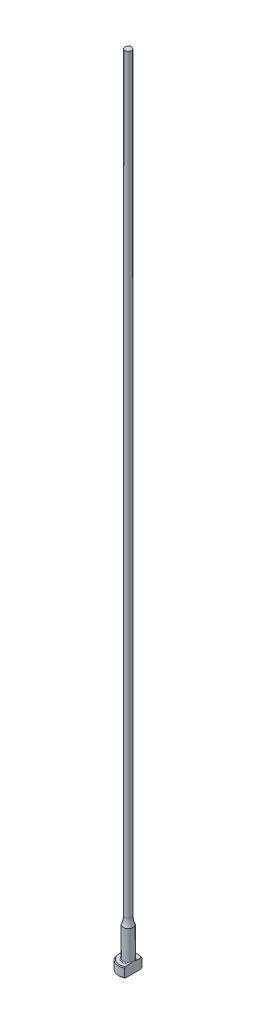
ISO-10303-21;
HEADER;
FILE_DESCRIPTION(('STEP AP214'),'2;1');
FILE_NAME('part.step','',(''),(''),'','','');
FILE_SCHEMA(('AUTOMOTIVE_DESIGN { 1 0 10303 214 1 1 1 1 }'));
ENDSEC;
DATA;
#1=APPLICATION_CONTEXT('core data for automotive mechanical design processes');
#2=APPLICATION_PROTOCOL_DEFINITION('international standard','automotive_design',2000,#1);
#3=PRODUCT_CONTEXT('',#1,'mechanical');
#4=PRODUCT('Part','Part','',(#3));
#5=PRODUCT_RELATED_PRODUCT_CATEGORY('part','',(#4));
#6=PRODUCT_DEFINITION_FORMATION('','',#4);
#7=PRODUCT_DEFINITION_CONTEXT('part definition',#1,'design');
#8=PRODUCT_DEFINITION('design','',#6,#7);
#9=PRODUCT_DEFINITION_SHAPE('','',#8);
#10=(LENGTH_UNIT() NAMED_UNIT(*) SI_UNIT(.MILLI.,.METRE.));
#11=(NAMED_UNIT(*) PLANE_ANGLE_UNIT() SI_UNIT($,.RADIAN.));
#12=(NAMED_UNIT(*) SI_UNIT($,.STERADIAN.) SOLID_ANGLE_UNIT());
#13=UNCERTAINTY_MEASURE_WITH_UNIT(LENGTH_MEASURE(1.E-05),#10,'distance_accuracy_value','');
#14=(GEOMETRIC_REPRESENTATION_CONTEXT(3) GLOBAL_UNCERTAINTY_ASSIGNED_CONTEXT((#13)) GLOBAL_UNIT_ASSIGNED_CONTEXT((#10,
#11,#12)) REPRESENTATION_CONTEXT('',''));
#15=CARTESIAN_POINT('',(0.,0.,0.));
#16=DIRECTION('',(0.,0.,1.));
#17=DIRECTION('',(1.,0.,0.));
#18=AXIS2_PLACEMENT_3D('',#15,#16,#17);
#19=CARTESIAN_POINT('',(-3.17499999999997,3.175,0.));
#20=DIRECTION('',(0.,1.,0.));
#21=DIRECTION('',(0.,0.,1.));
#22=AXIS2_PLACEMENT_3D('',#19,#20,#21);
#23=PLANE('',#22);
#24=CARTESIAN_POINT('',(0.,3.175,0.));
#25=DIRECTION('',(0.,1.,0.));
#26=DIRECTION('',(0.,0.,1.));
#27=AXIS2_PLACEMENT_3D('',#24,#25,#26);
#28=CIRCLE('',#27,2.92099999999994);
#29=CARTESIAN_POINT('',(1.58749999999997,3.175,-2.45195529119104));
#30=VERTEX_POINT('',#29);
#31=CARTESIAN_POINT('',(1.58749999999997,3.175,2.45195529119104));
#32=VERTEX_POINT('',#31);
#33=EDGE_CURVE('E105',#30,#32,#28,.T.);
#34=ORIENTED_EDGE('',*,*,#33,.T.);
#35=DIRECTION('',(0.,0.,1.));
#36=VECTOR('',#35,1.);
#37=CARTESIAN_POINT('',(1.58749999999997,3.17499999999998,2.74963065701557));
#38=LINE('',#37,#36);
#39=CARTESIAN_POINT('',(1.58749999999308,3.175,0.933255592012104));
#40=VERTEX_POINT('',#39);
#41=EDGE_CURVE('E126',#40,#32,#38,.T.);
#42=ORIENTED_EDGE('',*,*,#41,.F.);
#43=CARTESIAN_POINT('',(0.,3.175,0.));
#44=DIRECTION('',(0.,1.,0.));
#45=DIRECTION('',(0.,0.,1.));
#46=AXIS2_PLACEMENT_3D('',#43,#44,#45);
#47=CIRCLE('',#46,1.84149999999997);
#48=CARTESIAN_POINT('',(1.58749999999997,3.17500000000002,-0.933255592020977));
#49=VERTEX_POINT('',#48);
#50=EDGE_CURVE('E11',#40,#49,#47,.F.);
#51=ORIENTED_EDGE('',*,*,#50,.T.);
#52=EDGE_CURVE('E52',#30,#49,#38,.T.);
#53=ORIENTED_EDGE('',*,*,#52,.F.);
#54=EDGE_LOOP('',(#34,#42,#51,#53));
#55=FACE_BOUND('',#54,.T.);
#56=ADVANCED_FACE('F32',(#55),#23,.T.);
#57=CARTESIAN_POINT('',(0.,259.958771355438,0.));
#58=DIRECTION('',(0.,1.,0.));
#59=DIRECTION('',(0.,0.,1.));
#60=AXIS2_PLACEMENT_3D('',#57,#58,#59);
#61=CYLINDRICAL_SURFACE('',#60,3.17499999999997);
#62=CARTESIAN_POINT('',(0.,2.92100000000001,0.));
#63=DIRECTION('',(0.,1.,0.));
#64=DIRECTION('',(0.,0.,1.));
#65=AXIS2_PLACEMENT_3D('',#62,#63,#64);
#66=CIRCLE('',#65,3.17499999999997);
#67=CARTESIAN_POINT('',(1.58749999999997,2.92100000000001,2.74963065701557));
#68=VERTEX_POINT('',#67);
#69=CARTESIAN_POINT('',(1.58749999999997,2.92100000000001,-2.74963065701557));
#70=VERTEX_POINT('',#69);
#71=EDGE_CURVE('E98',#68,#70,#66,.F.);
#72=ORIENTED_EDGE('',*,*,#71,.T.);
#73=DIRECTION('',(0.,-1.,0.));
#74=VECTOR('',#73,1.);
#75=CARTESIAN_POINT('',(1.58749999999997,254.001,-2.74963065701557));
#76=LINE('',#75,#74);
#77=CARTESIAN_POINT('',(1.58749999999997,0.253999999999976,-2.74963065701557));
#78=VERTEX_POINT('',#77);
#79=EDGE_CURVE('E141',#70,#78,#76,.T.);
#80=ORIENTED_EDGE('',*,*,#79,.T.);
#81=CARTESIAN_POINT('',(0.,0.253999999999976,0.));
#82=DIRECTION('',(0.,-1.,0.));
#83=DIRECTION('',(0.,0.,-1.));
#84=AXIS2_PLACEMENT_3D('',#81,#82,#83);
#85=CIRCLE('',#84,3.17499999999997);
#86=CARTESIAN_POINT('',(1.58749999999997,0.253999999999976,2.74963065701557));
#87=VERTEX_POINT('',#86);
#88=EDGE_CURVE('E95',#78,#87,#85,.F.);
#89=ORIENTED_EDGE('',*,*,#88,.T.);
#90=DIRECTION('',(0.,-1.,0.));
#91=VECTOR('',#90,1.);
#92=CARTESIAN_POINT('',(1.58749999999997,254.001,2.74963065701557));
#93=LINE('',#92,#91);
#94=EDGE_CURVE('E88',#68,#87,#93,.T.);
#95=ORIENTED_EDGE('',*,*,#94,.F.);
#96=EDGE_LOOP('',(#72,#80,#89,#95));
#97=FACE_BOUND('',#96,.T.);
#98=ADVANCED_FACE('F191',(#97),#61,.T.);
#99=CARTESIAN_POINT('',(0.,0.,0.));
#100=DIRECTION('',(0.,-1.,0.));
#101=DIRECTION('',(0.,0.,-1.));
#102=AXIS2_PLACEMENT_3D('',#99,#100,#101);
#103=PLANE('',#102);
#104=CARTESIAN_POINT('',(0.,0.,0.));
#105=DIRECTION('',(0.,-1.,0.));
#106=DIRECTION('',(0.,0.,-1.));
#107=AXIS2_PLACEMENT_3D('',#104,#105,#106);
#108=CIRCLE('',#107,2.92100000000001);
#109=CARTESIAN_POINT('',(1.58749999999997,0.,2.45195529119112));
#110=VERTEX_POINT('',#109);
#111=CARTESIAN_POINT('',(1.58749999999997,0.,-2.45195529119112));
#112=VERTEX_POINT('',#111);
#113=EDGE_CURVE('E93',#110,#112,#108,.T.);
#114=ORIENTED_EDGE('',*,*,#113,.T.);
#115=DIRECTION('',(0.,0.,1.));
#116=VECTOR('',#115,1.);
#117=CARTESIAN_POINT('',(1.58749999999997,0.,2.74963065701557));
#118=LINE('',#117,#116);
#119=EDGE_CURVE('E78',#112,#110,#118,.T.);
#120=ORIENTED_EDGE('',*,*,#119,.T.);
#121=EDGE_LOOP('',(#114,#120));
#122=FACE_BOUND('',#121,.T.);
#123=ADVANCED_FACE('F97',(#122),#103,.T.);
#124=CARTESIAN_POINT('',(0.,3.17499999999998,0.));
#125=DIRECTION('',(0.,-1.,0.));
#126=DIRECTION('',(0.,0.,-1.));
#127=AXIS2_PLACEMENT_3D('',#124,#125,#126);
#128=CONICAL_SURFACE('',#127,2.92099999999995,0.785398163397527);
#129=ORIENTED_EDGE('',*,*,#71,.F.);
#130=CARTESIAN_POINT('',(1.58749999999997,-0.16162066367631,-6.0529050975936));
#131=CARTESIAN_POINT('',(1.58749999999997,-0.0288893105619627,-5.91567682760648));
#132=CARTESIAN_POINT('',(1.58749999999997,0.103699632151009,-5.7783103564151));
#133=CARTESIAN_POINT('',(1.58749999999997,0.368508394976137,-5.50321874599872));
#134=CARTESIAN_POINT('',(1.58749999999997,0.500728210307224,-5.36549360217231));
#135=CARTESIAN_POINT('',(1.58749999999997,0.764778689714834,-5.08953516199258));
#136=CARTESIAN_POINT('',(1.58749999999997,0.896609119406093,-4.9513016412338));
#137=CARTESIAN_POINT('',(1.58749999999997,1.15968706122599,-4.67428233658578));
#138=CARTESIAN_POINT('',(1.58749999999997,1.29093457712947,-4.53549655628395));
#139=CARTESIAN_POINT('',(1.58749999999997,1.55007705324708,-4.25997724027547));
#140=CARTESIAN_POINT('',(1.58749999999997,1.67798684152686,-4.12325766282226));
#141=CARTESIAN_POINT('',(1.58749999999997,1.9328486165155,-3.84892898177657));
#142=CARTESIAN_POINT('',(1.58749999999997,2.05980060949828,-3.71131988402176));
#143=CARTESIAN_POINT('',(1.58749999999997,2.31237508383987,-3.43493978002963));
#144=CARTESIAN_POINT('',(1.58749999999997,2.43799784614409,-3.29616903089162));
#145=CARTESIAN_POINT('',(1.58749999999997,2.68741369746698,-3.01699558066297));
#146=CARTESIAN_POINT('',(1.58749999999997,2.81120686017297,-2.8765929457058));
#147=CARTESIAN_POINT('',(1.58749999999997,3.00875865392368,-2.64816703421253));
#148=CARTESIAN_POINT('',(1.58749999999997,3.08336151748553,-2.56087478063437));
#149=CARTESIAN_POINT('',(1.58749999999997,3.2312387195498,-2.38515423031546));
#150=CARTESIAN_POINT('',(1.58749999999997,3.30451292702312,-2.29672582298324));
#151=CARTESIAN_POINT('',(1.58749999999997,3.45004422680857,-2.1174740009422));
#152=CARTESIAN_POINT('',(1.58749999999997,3.5222823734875,-2.02663514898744));
#153=CARTESIAN_POINT('',(1.58749999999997,3.66423097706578,-1.8430252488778));
#154=CARTESIAN_POINT('',(1.58749999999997,3.73394203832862,-1.75025467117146));
#155=CARTESIAN_POINT('',(1.58749999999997,3.87080633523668,-1.5606747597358));
#156=CARTESIAN_POINT('',(1.58749999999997,3.93790459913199,-1.46382547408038));
#157=CARTESIAN_POINT('',(1.58749999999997,4.06669147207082,-1.26632594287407));
#158=CARTESIAN_POINT('',(1.58749999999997,4.1283726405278,-1.16567073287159));
#159=CARTESIAN_POINT('',(1.58749999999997,4.21402252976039,-1.01165766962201));
#160=CARTESIAN_POINT('',(1.58749999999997,4.24127929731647,-0.960142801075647));
#161=CARTESIAN_POINT('',(1.58749999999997,4.2930979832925,-0.855780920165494));
#162=CARTESIAN_POINT('',(1.58749999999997,4.31765941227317,-0.802933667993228));
#163=CARTESIAN_POINT('',(1.58749999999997,4.38614656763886,-0.642461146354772));
#164=CARTESIAN_POINT('',(1.58749999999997,4.42510149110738,-0.532518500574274));
#165=CARTESIAN_POINT('',(1.58749999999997,4.46726244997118,-0.367680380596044));
#166=CARTESIAN_POINT('',(1.58749999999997,4.47844427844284,-0.314802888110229));
#167=CARTESIAN_POINT('',(1.58749999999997,4.49576654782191,-0.208209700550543));
#168=CARTESIAN_POINT('',(1.58749999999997,4.50190743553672,-0.154494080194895));
#169=CARTESIAN_POINT('',(1.58749999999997,4.50871296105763,-0.0468792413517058));
#170=CARTESIAN_POINT('',(1.58749999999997,4.5093945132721,0.00701889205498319));
#171=CARTESIAN_POINT('',(1.58749999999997,4.50527679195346,0.114606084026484));
#172=CARTESIAN_POINT('',(1.58749999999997,4.50047706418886,0.168295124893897));
#173=CARTESIAN_POINT('',(1.58749999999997,4.48579689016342,0.27448544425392));
#174=CARTESIAN_POINT('',(1.58749999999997,4.47596081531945,0.32699298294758));
#175=CARTESIAN_POINT('',(1.58749999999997,4.45181809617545,0.430974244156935));
#176=CARTESIAN_POINT('',(1.58749999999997,4.4375096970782,0.482447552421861));
#177=CARTESIAN_POINT('',(1.58749999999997,4.40502489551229,0.584460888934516));
#178=CARTESIAN_POINT('',(1.58749999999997,4.386827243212,0.634994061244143));
#179=CARTESIAN_POINT('',(1.58749999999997,4.34729308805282,0.734789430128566));
#180=CARTESIAN_POINT('',(1.58749999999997,4.3259572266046,0.784051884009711));
#181=CARTESIAN_POINT('',(1.58749999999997,4.25791922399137,0.930549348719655));
#182=CARTESIAN_POINT('',(1.58749999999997,4.20736047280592,1.0259880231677));
#183=CARTESIAN_POINT('',(1.58749999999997,4.0995545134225,1.21304313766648));
#184=CARTESIAN_POINT('',(1.58749999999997,4.04229912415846,1.30465471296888));
#185=CARTESIAN_POINT('',(1.58749999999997,3.92308746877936,1.48526211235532));
#186=CARTESIAN_POINT('',(1.58749999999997,3.86111349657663,1.57424615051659));
#187=CARTESIAN_POINT('',(1.58749999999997,3.73408621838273,1.74990003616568));
#188=CARTESIAN_POINT('',(1.58749999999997,3.66903444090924,1.83657099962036));
#189=CARTESIAN_POINT('',(1.58749999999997,3.53583371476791,2.00931764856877));
#190=CARTESIAN_POINT('',(1.58749999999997,3.46765527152,2.09537048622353));
#191=CARTESIAN_POINT('',(1.58749999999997,3.32960643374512,2.26611736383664));
#192=CARTESIAN_POINT('',(1.58749999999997,3.25973586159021,2.35081125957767));
#193=CARTESIAN_POINT('',(1.58749999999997,3.04858139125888,2.60290121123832));
#194=CARTESIAN_POINT('',(1.58749999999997,2.90542388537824,2.76872537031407));
#195=CARTESIAN_POINT('',(1.58749999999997,2.64069522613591,3.06970913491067));
#196=CARTESIAN_POINT('',(1.58749999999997,2.51959458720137,3.20528660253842));
#197=CARTESIAN_POINT('',(1.58749999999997,2.27590400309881,3.47510321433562));
#198=CARTESIAN_POINT('',(1.58749999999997,2.15331401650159,3.60934232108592));
#199=CARTESIAN_POINT('',(1.58749999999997,1.90694239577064,3.87695374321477));
#200=CARTESIAN_POINT('',(1.58749999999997,1.78315974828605,4.0103251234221));
#201=CARTESIAN_POINT('',(1.58749999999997,1.53478104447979,4.27630880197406));
#202=CARTESIAN_POINT('',(1.58749999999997,1.41018498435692,4.40892109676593));
#203=CARTESIAN_POINT('',(1.58749999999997,1.0457468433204,4.79499418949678));
#204=CARTESIAN_POINT('',(1.58749999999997,0.80507680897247,5.04767313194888));
#205=CARTESIAN_POINT('',(1.58749999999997,0.443121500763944,5.42550911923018));
#206=CARTESIAN_POINT('',(1.58749999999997,0.322378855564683,5.55118772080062));
#207=CARTESIAN_POINT('',(1.58749999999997,0.0805914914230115,5.80225207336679));
#208=CARTESIAN_POINT('',(1.58749999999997,-0.040453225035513,5.92763782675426));
#209=CARTESIAN_POINT('',(1.58749999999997,-0.161620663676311,6.0529050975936));
#210=B_SPLINE_CURVE_WITH_KNOTS('',3,(#130,#131,#132,#133,#134,#135,#136,#137,#138,#139,#140,
#141,#142,#143,#144,#145,#146,#147,#148,#149,#150,#151,#152,#153,#154,#155,#156,#157,#158,#159,
#160,#161,#162,#163,#164,#165,#166,#167,#168,#169,#170,#171,#172,#173,#174,#175,#176,#177,#178,
#179,#180,#181,#182,#183,#184,#185,#186,#187,#188,#189,#190,#191,#192,#193,#194,#195,#196,#197,
#198,#199,#200,#201,#202,#203,#204,#205,#206,#207,#208,#209),.UNSPECIFIED.,.F.,.F.,(4,2,2,2,2,2,
2,2,2,2,2,2,2,2,2,2,2,2,2,2,2,2,2,2,2,2,2,2,2,2,2,2,2,2,2,2,2,2,2,4),(0.,0.572750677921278,
1.14550874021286,1.71856057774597,2.29160869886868,2.85328006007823,3.4149477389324,
3.97649423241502,4.53801804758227,4.88249307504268,5.22700189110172,5.5751532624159,
5.92322081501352,6.27657800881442,6.63041319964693,6.80518126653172,6.9799810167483,
7.3282426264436,7.49018491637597,7.65211285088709,7.81353889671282,7.97497832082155,
8.13501929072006,8.29512313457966,8.45612518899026,8.61709438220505,8.94062993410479,
9.2645649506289,9.58978187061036,9.91483894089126,10.2441741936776,10.5735441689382,
11.2306812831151,11.7760337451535,12.3214014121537,12.8672825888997,13.4131663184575,
14.4600164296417,14.9828595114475,15.5056983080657),.UNSPECIFIED.);
#211=EDGE_CURVE('E118',#32,#68,#210,.T.);
#212=ORIENTED_EDGE('',*,*,#211,.F.);
#213=ORIENTED_EDGE('',*,*,#33,.F.);
#214=EDGE_CURVE('E117',#70,#30,#210,.T.);
#215=ORIENTED_EDGE('',*,*,#214,.F.);
#216=EDGE_LOOP('',(#129,#212,#213,#215));
#217=FACE_BOUND('',#216,.T.);
#218=ADVANCED_FACE('F162',(#217),#128,.T.);
#219=CARTESIAN_POINT('',(0.,0.253999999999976,0.));
#220=DIRECTION('',(0.,1.,0.));
#221=DIRECTION('',(0.,0.,1.));
#222=AXIS2_PLACEMENT_3D('',#219,#220,#221);
#223=CONICAL_SURFACE('',#222,3.17499999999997,0.785398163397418);
#224=ORIENTED_EDGE('',*,*,#88,.F.);
#225=CARTESIAN_POINT('',(1.58749999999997,3.33662066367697,6.0529050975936));
#226=CARTESIAN_POINT('',(1.58749999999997,3.20388931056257,5.91567682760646));
#227=CARTESIAN_POINT('',(1.58749999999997,3.07130036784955,5.77831035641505));
#228=CARTESIAN_POINT('',(1.58749999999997,2.80649160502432,5.50321874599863));
#229=CARTESIAN_POINT('',(1.58749999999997,2.67427178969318,5.3654936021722));
#230=CARTESIAN_POINT('',(1.58749999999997,2.41022131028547,5.08953516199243));
#231=CARTESIAN_POINT('',(1.58749999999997,2.27839088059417,4.95130164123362));
#232=CARTESIAN_POINT('',(1.58749999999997,2.01531293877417,4.67428233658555));
#233=CARTESIAN_POINT('',(1.58749999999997,1.88406542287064,4.5354965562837));
#234=CARTESIAN_POINT('',(1.58749999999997,1.62492294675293,4.25997724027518));
#235=CARTESIAN_POINT('',(1.58749999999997,1.49701315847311,4.12325766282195));
#236=CARTESIAN_POINT('',(1.58749999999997,1.24215138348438,3.84892898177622));
#237=CARTESIAN_POINT('',(1.58749999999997,1.11519939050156,3.71131988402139));
#238=CARTESIAN_POINT('',(1.58749999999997,0.862624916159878,3.43493978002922));
#239=CARTESIAN_POINT('',(1.58749999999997,0.737002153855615,3.29616903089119));
#240=CARTESIAN_POINT('',(1.58749999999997,0.487586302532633,3.01699558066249));
#241=CARTESIAN_POINT('',(1.58749999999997,0.363793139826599,2.8765929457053));
#242=CARTESIAN_POINT('',(1.58749999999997,0.166241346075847,2.64816703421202));
#243=CARTESIAN_POINT('',(1.58749999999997,0.0916384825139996,2.56087478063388));
#244=CARTESIAN_POINT('',(1.58749999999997,-0.0562387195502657,2.385154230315));
#245=CARTESIAN_POINT('',(1.58749999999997,-0.129512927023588,2.29672582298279));
#246=CARTESIAN_POINT('',(1.58749999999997,-0.27504422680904,2.11747400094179));
#247=CARTESIAN_POINT('',(1.58749999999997,-0.347282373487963,2.02663514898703));
#248=CARTESIAN_POINT('',(1.58749999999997,-0.489230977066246,1.84302524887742));
#249=CARTESIAN_POINT('',(1.58749999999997,-0.558942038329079,1.7502546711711));
#250=CARTESIAN_POINT('',(1.58749999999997,-0.695806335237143,1.56067475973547));
#251=CARTESIAN_POINT('',(1.58749999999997,-0.762904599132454,1.46382547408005));
#252=CARTESIAN_POINT('',(1.58749999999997,-0.891691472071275,1.26632594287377));
#253=CARTESIAN_POINT('',(1.58749999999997,-0.953372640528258,1.16567073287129));
#254=CARTESIAN_POINT('',(1.58749999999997,-1.03902252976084,1.01165766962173));
#255=CARTESIAN_POINT('',(1.58749999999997,-1.06627929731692,0.960142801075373));
#256=CARTESIAN_POINT('',(1.58749999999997,-1.11809798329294,0.85578092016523));
#257=CARTESIAN_POINT('',(1.58749999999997,-1.14265941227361,0.802933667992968));
#258=CARTESIAN_POINT('',(1.58749999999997,-1.21114656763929,0.642461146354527));
#259=CARTESIAN_POINT('',(1.58749999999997,-1.2501014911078,0.532518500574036));
#260=CARTESIAN_POINT('',(1.58749999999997,-1.29226244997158,0.367680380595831));
#261=CARTESIAN_POINT('',(1.58749999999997,-1.30344427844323,0.314802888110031));
#262=CARTESIAN_POINT('',(1.58749999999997,-1.32076654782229,0.208209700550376));
#263=CARTESIAN_POINT('',(1.58749999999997,-1.3269074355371,0.154494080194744));
#264=CARTESIAN_POINT('',(1.58749999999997,-1.333712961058,0.0468792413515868));
#265=CARTESIAN_POINT('',(1.58749999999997,-1.33439451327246,-0.00701889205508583));
#266=CARTESIAN_POINT('',(1.58749999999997,-1.33027679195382,-0.114606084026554));
#267=CARTESIAN_POINT('',(1.58749999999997,-1.32547706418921,-0.168295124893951));
#268=CARTESIAN_POINT('',(1.58749999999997,-1.31079689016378,-0.274485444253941));
#269=CARTESIAN_POINT('',(1.58749999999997,-1.3009608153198,-0.326992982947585));
#270=CARTESIAN_POINT('',(1.58749999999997,-1.27681809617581,-0.430974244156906));
#271=CARTESIAN_POINT('',(1.58749999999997,-1.26250969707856,-0.482447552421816));
#272=CARTESIAN_POINT('',(1.58749999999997,-1.23002489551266,-0.584460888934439));
#273=CARTESIAN_POINT('',(1.58749999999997,-1.21182724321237,-0.634994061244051));
#274=CARTESIAN_POINT('',(1.58749999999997,-1.1722930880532,-0.734789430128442));
#275=CARTESIAN_POINT('',(1.58749999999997,-1.15095722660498,-0.784051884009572));
#276=CARTESIAN_POINT('',(1.58749999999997,-1.08291922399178,-0.93054934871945));
#277=CARTESIAN_POINT('',(1.58749999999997,-1.03236047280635,-1.02598802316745));
#278=CARTESIAN_POINT('',(1.58749999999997,-0.924554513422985,-1.21304313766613));
#279=CARTESIAN_POINT('',(1.58749999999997,-0.86729912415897,-1.30465471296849));
#280=CARTESIAN_POINT('',(1.58749999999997,-0.748087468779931,-1.48526211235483));
#281=CARTESIAN_POINT('',(1.58749999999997,-0.686113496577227,-1.57424615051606));
#282=CARTESIAN_POINT('',(1.58749999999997,-0.55908621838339,-1.74990003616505));
#283=CARTESIAN_POINT('',(1.58749999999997,-0.494034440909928,-1.83657099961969));
#284=CARTESIAN_POINT('',(1.58749999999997,-0.360833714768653,-2.00931764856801));
#285=CARTESIAN_POINT('',(1.58749999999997,-0.292655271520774,-2.09537048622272));
#286=CARTESIAN_POINT('',(1.58749999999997,-0.154606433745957,-2.26611736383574));
#287=CARTESIAN_POINT('',(1.58749999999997,-0.0847358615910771,-2.35081125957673));
#288=CARTESIAN_POINT('',(1.58749999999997,0.126418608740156,-2.60290121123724));
#289=CARTESIAN_POINT('',(1.58749999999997,0.269576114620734,-2.76872537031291));
#290=CARTESIAN_POINT('',(1.58749999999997,0.534304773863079,-3.06970913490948));
#291=CARTESIAN_POINT('',(1.58749999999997,0.655405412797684,-3.20528660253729));
#292=CARTESIAN_POINT('',(1.58749999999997,0.899095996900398,-3.47510321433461));
#293=CARTESIAN_POINT('',(1.58749999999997,1.02168598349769,-3.60934232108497));
#294=CARTESIAN_POINT('',(1.58749999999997,1.26805760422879,-3.87695374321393));
#295=CARTESIAN_POINT('',(1.58749999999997,1.39184025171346,-4.01032512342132));
#296=CARTESIAN_POINT('',(1.58749999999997,1.64021895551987,-4.2763088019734));
#297=CARTESIAN_POINT('',(1.58749999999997,1.76481501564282,-4.40892109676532));
#298=CARTESIAN_POINT('',(1.58749999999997,2.12925315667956,-4.79499418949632));
#299=CARTESIAN_POINT('',(1.58749999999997,2.36992319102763,-5.04767313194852));
#300=CARTESIAN_POINT('',(1.58749999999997,2.73187849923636,-5.42550911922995));
#301=CARTESIAN_POINT('',(1.58749999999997,2.85262114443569,-5.55118772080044));
#302=CARTESIAN_POINT('',(1.58749999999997,3.09440850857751,-5.8022520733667));
#303=CARTESIAN_POINT('',(1.58749999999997,3.2154532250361,-5.92763782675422));
#304=CARTESIAN_POINT('',(1.58749999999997,3.33662066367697,-6.0529050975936));
#305=B_SPLINE_CURVE_WITH_KNOTS('',3,(#225,#226,#227,#228,#229,#230,#231,#232,#233,#234,#235,
#236,#237,#238,#239,#240,#241,#242,#243,#244,#245,#246,#247,#248,#249,#250,#251,#252,#253,#254,
#255,#256,#257,#258,#259,#260,#261,#262,#263,#264,#265,#266,#267,#268,#269,#270,#271,#272,#273,
#274,#275,#276,#277,#278,#279,#280,#281,#282,#283,#284,#285,#286,#287,#288,#289,#290,#291,#292,
#293,#294,#295,#296,#297,#298,#299,#300,#301,#302,#303,#304),.UNSPECIFIED.,.F.,.F.,(4,2,2,2,2,2,
2,2,2,2,2,2,2,2,2,2,2,2,2,2,2,2,2,2,2,2,2,2,2,2,2,2,2,2,2,2,2,2,2,4),(0.,0.57275067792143,
1.14550874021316,1.71856057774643,2.29160869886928,2.85328006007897,3.41494773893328,
3.97649423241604,4.53801804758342,4.88249307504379,5.2270018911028,5.57515326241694,
5.92322081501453,6.27657800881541,6.63041319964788,6.80518126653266,6.97998101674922,
7.32824262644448,7.49018491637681,7.65211285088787,7.81353889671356,7.97497832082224,
8.1350192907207,8.29512313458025,8.45612518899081,8.61709438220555,8.94062993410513,
9.26456495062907,9.58978187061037,9.91483894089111,10.2441741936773,10.5735441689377,
11.2306812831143,11.776033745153,12.3214014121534,12.8672825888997,13.4131663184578,
14.4600164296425,14.9828595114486,15.505698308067),.UNSPECIFIED.);
#306=EDGE_CURVE('E81',#112,#78,#305,.T.);
#307=ORIENTED_EDGE('',*,*,#306,.F.);
#308=ORIENTED_EDGE('',*,*,#113,.F.);
#309=EDGE_CURVE('E84',#87,#110,#305,.T.);
#310=ORIENTED_EDGE('',*,*,#309,.F.);
#311=EDGE_LOOP('',(#224,#307,#308,#310));
#312=FACE_BOUND('',#311,.T.);
#313=ADVANCED_FACE('F92',(#312),#223,.T.);
#314=CARTESIAN_POINT('',(0.,3.42900000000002,0.));
#315=DIRECTION('',(0.,1.,0.));
#316=DIRECTION('',(0.,0.,1.));
#317=AXIS2_PLACEMENT_3D('',#314,#315,#316);
#318=TOROIDAL_SURFACE('',#317,1.84149999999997,0.254);
#319=CARTESIAN_POINT('',(1.58749999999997,3.42900000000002,0.));
#320=CARTESIAN_POINT('',(1.58749999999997,3.42899942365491,-1.9220514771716E-10));
#321=CARTESIAN_POINT('',(1.58749999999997,3.42899884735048,-1.2261161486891E-07));
#322=CARTESIAN_POINT('',(1.58749999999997,3.42899773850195,-5.09676365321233E-07));
#323=CARTESIAN_POINT('',(1.58749999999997,3.42899720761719,-7.78176328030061E-07));
#324=CARTESIAN_POINT('',(1.58749999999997,3.42899614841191,-1.42307272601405E-06));
#325=CARTESIAN_POINT('',(1.58749999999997,3.42899562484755,-1.80713867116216E-06));
#326=CARTESIAN_POINT('',(1.58749999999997,3.42899463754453,-2.63494846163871E-06));
#327=CARTESIAN_POINT('',(1.58749999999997,3.42899417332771,-3.07814756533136E-06));
#328=CARTESIAN_POINT('',(1.58749999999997,3.42899261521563,-4.66897357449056E-06));
#329=CARTESIAN_POINT('',(1.58749999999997,3.42899159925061,-5.89404908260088E-06));
#330=CARTESIAN_POINT('',(1.58749999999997,3.42898979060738,-8.42427511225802E-06));
#331=CARTESIAN_POINT('',(1.58749999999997,3.42898899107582,-9.7248057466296E-06));
#332=CARTESIAN_POINT('',(1.58749999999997,3.42898598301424,-1.48060601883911E-05));
#333=CARTESIAN_POINT('',(1.58749999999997,3.42898393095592,-1.86838281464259E-05));
#334=CARTESIAN_POINT('',(1.58749999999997,3.42898057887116,-2.63261117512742E-05));
#335=CARTESIAN_POINT('',(1.58749999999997,3.42897922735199,-3.00687417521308E-05));
#336=CARTESIAN_POINT('',(1.58749999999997,3.42897347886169,-4.60276298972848E-05));
#337=CARTESIAN_POINT('',(1.58749999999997,3.42896911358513,-5.8247019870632E-05));
#338=CARTESIAN_POINT('',(1.58749999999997,3.42896211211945,-8.11070097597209E-05));
#339=CARTESIAN_POINT('',(1.58749999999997,3.42895931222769,-9.16953114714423E-05));
#340=CARTESIAN_POINT('',(1.58749999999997,3.42893712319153,-0.000168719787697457));
#341=CARTESIAN_POINT('',(1.58749999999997,3.42890881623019,-0.000232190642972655));
#342=CARTESIAN_POINT('',(1.58749999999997,3.42880276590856,-0.000479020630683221));
#343=CARTESIAN_POINT('',(1.58749999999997,3.42873165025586,-0.00066443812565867));
#344=CARTESIAN_POINT('',(1.58749999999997,3.42845137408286,-0.0013844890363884));
#345=CARTESIAN_POINT('',(1.58749999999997,3.42823526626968,-0.00191701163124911));
#346=CARTESIAN_POINT('',(1.58749999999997,3.42735449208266,-0.00409774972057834));
#347=CARTESIAN_POINT('',(1.58749999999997,3.42669768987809,-0.00574830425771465));
#348=CARTESIAN_POINT('',(1.58749999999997,3.4174405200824,-0.0289985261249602));
#349=CARTESIAN_POINT('',(1.58749999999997,3.40878325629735,-0.0505816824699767));
#350=CARTESIAN_POINT('',(1.58749999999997,3.39189297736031,-0.0929947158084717));
#351=CARTESIAN_POINT('',(1.58749999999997,3.38365605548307,-0.11382315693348));
#352=CARTESIAN_POINT('',(1.58749999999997,3.36635393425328,-0.157956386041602));
#353=CARTESIAN_POINT('',(1.58749999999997,3.35730391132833,-0.181267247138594));
#354=CARTESIAN_POINT('',(1.58749999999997,3.33936775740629,-0.228222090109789));
#355=CARTESIAN_POINT('',(1.58749999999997,3.33048420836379,-0.25186705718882));
#356=CARTESIAN_POINT('',(1.58749999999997,3.30894496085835,-0.310512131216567));
#357=CARTESIAN_POINT('',(1.58749999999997,3.29649449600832,-0.345588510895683));
#358=CARTESIAN_POINT('',(1.58749999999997,3.27296975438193,-0.415278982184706));
#359=CARTESIAN_POINT('',(1.58749999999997,3.26186987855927,-0.449884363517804));
#360=CARTESIAN_POINT('',(1.58749999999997,3.2395832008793,-0.524471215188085));
#361=CARTESIAN_POINT('',(1.58749999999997,3.22860862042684,-0.564517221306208));
#362=CARTESIAN_POINT('',(1.58749999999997,3.20902534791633,-0.645529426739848));
#363=CARTESIAN_POINT('',(1.58749999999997,3.20043582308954,-0.686500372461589));
#364=CARTESIAN_POINT('',(1.58749999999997,3.18611712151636,-0.771546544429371));
#365=CARTESIAN_POINT('',(1.58749999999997,3.18059550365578,-0.815658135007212));
#366=CARTESIAN_POINT('',(1.58749999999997,3.17455396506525,-0.904117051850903));
#367=CARTESIAN_POINT('',(1.58749999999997,3.17401361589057,-0.948462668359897));
#368=CARTESIAN_POINT('',(1.58749999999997,3.17898948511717,-1.02531896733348));
#369=CARTESIAN_POINT('',(1.58749999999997,3.1829739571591,-1.05792141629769));
#370=CARTESIAN_POINT('',(1.58749999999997,3.19569167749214,-1.12184393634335));
#371=CARTESIAN_POINT('',(1.58749999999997,3.20436049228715,-1.1531753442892));
#372=CARTESIAN_POINT('',(1.58749999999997,3.22236152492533,-1.19946468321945));
#373=CARTESIAN_POINT('',(1.58749999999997,3.2295150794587,-1.21526783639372));
#374=CARTESIAN_POINT('',(1.58749999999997,3.24587062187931,-1.24583726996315));
#375=CARTESIAN_POINT('',(1.58749999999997,3.25507530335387,-1.26060215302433));
#376=CARTESIAN_POINT('',(1.58749999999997,3.27378481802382,-1.28575815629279));
#377=CARTESIAN_POINT('',(1.58749999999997,3.28289001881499,-1.29644383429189));
#378=CARTESIAN_POINT('',(1.58749999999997,3.30268460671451,-1.31623154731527));
#379=CARTESIAN_POINT('',(1.58749999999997,3.31337067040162,-1.32533681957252));
#380=CARTESIAN_POINT('',(1.58749999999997,3.33349977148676,-1.33941140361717));
#381=CARTESIAN_POINT('',(1.58749999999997,3.34261446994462,-1.34484814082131));
#382=CARTESIAN_POINT('',(1.58749999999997,3.36161455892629,-1.35416329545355));
#383=CARTESIAN_POINT('',(1.58749999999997,3.37149946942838,-1.35804267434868));
#384=CARTESIAN_POINT('',(1.58749999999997,3.39188678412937,-1.36398436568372));
#385=CARTESIAN_POINT('',(1.58749999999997,3.40239309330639,-1.36603350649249));
#386=CARTESIAN_POINT('',(1.58749999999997,3.42360372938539,-1.3680840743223));
#387=CARTESIAN_POINT('',(1.58749999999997,3.43430795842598,-1.36808648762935));
#388=CARTESIAN_POINT('',(1.58749999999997,3.45433283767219,-1.36616208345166));
#389=CARTESIAN_POINT('',(1.58749999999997,3.46367506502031,-1.36444960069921));
#390=CARTESIAN_POINT('',(1.58749999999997,3.48195519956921,-1.35953338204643));
#391=CARTESIAN_POINT('',(1.58749999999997,3.49089304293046,-1.3563294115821));
#392=CARTESIAN_POINT('',(1.58749999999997,3.50850302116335,-1.34848006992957));
#393=CARTESIAN_POINT('',(1.58749999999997,3.5171531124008,-1.34378578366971));
#394=CARTESIAN_POINT('',(1.58749999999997,3.53371257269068,-1.33324445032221));
#395=CARTESIAN_POINT('',(1.58749999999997,3.54162163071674,-1.32739692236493));
#396=CARTESIAN_POINT('',(1.58749999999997,3.56107121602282,-1.31107304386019));
#397=CARTESIAN_POINT('',(1.58749999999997,3.57202221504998,-1.29989286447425));
#398=CARTESIAN_POINT('',(1.58749999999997,3.59202509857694,-1.27593566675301));
#399=CARTESIAN_POINT('',(1.58749999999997,3.60107086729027,-1.26315370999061));
#400=CARTESIAN_POINT('',(1.58749999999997,3.62186023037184,-1.22930733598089));
#401=CARTESIAN_POINT('',(1.58749999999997,3.63240584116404,-1.20751096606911));
#402=CARTESIAN_POINT('',(1.58749999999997,3.65004643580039,-1.16266144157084));
#403=CARTESIAN_POINT('',(1.58749999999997,3.65714435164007,-1.13960937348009));
#404=CARTESIAN_POINT('',(1.58749999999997,3.67265428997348,-1.07603916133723));
#405=CARTESIAN_POINT('',(1.58749999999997,3.67834921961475,-1.03486686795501));
#406=CARTESIAN_POINT('',(1.58749999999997,3.68382880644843,-0.951558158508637));
#407=CARTESIAN_POINT('',(1.58749999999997,3.68350976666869,-0.909417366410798));
#408=CARTESIAN_POINT('',(1.58749999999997,3.67745397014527,-0.811383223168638));
#409=CARTESIAN_POINT('',(1.58749999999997,3.66993873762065,-0.755610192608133));
#410=CARTESIAN_POINT('',(1.58749999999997,3.64933373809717,-0.644937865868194));
#411=CARTESIAN_POINT('',(1.58749999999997,3.63621897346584,-0.59004364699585));
#412=CARTESIAN_POINT('',(1.58749999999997,3.60740922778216,-0.485757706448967));
#413=CARTESIAN_POINT('',(1.58749999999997,3.59201096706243,-0.436281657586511));
#414=CARTESIAN_POINT('',(1.58749999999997,3.55922497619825,-0.338551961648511));
#415=CARTESIAN_POINT('',(1.58749999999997,3.5418584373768,-0.290291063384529));
#416=CARTESIAN_POINT('',(1.58749999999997,3.51760237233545,-0.225557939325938));
#417=CARTESIAN_POINT('',(1.58749999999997,3.51126413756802,-0.208874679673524));
#418=CARTESIAN_POINT('',(1.58749999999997,3.49830042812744,-0.17512392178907));
#419=CARTESIAN_POINT('',(1.58749999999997,3.49167176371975,-0.158057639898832));
#420=CARTESIAN_POINT('',(1.58749999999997,3.47585523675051,-0.117638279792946));
#421=CARTESIAN_POINT('',(1.58749999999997,3.46662970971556,-0.0943002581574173));
#422=CARTESIAN_POINT('',(1.58749999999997,3.44889695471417,-0.0497824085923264));
#423=CARTESIAN_POINT('',(1.58749999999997,3.44040039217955,-0.028598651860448));
#424=CARTESIAN_POINT('',(1.58749999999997,3.43130364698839,-0.00575168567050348));
#425=CARTESIAN_POINT('',(1.58749999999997,3.43064818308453,-0.00410451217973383));
#426=CARTESIAN_POINT('',(1.58749999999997,3.42976776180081,-0.00192459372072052));
#427=CARTESIAN_POINT('',(1.58749999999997,3.42955062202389,-0.00138952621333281));
#428=CARTESIAN_POINT('',(1.58749999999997,3.42926908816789,-0.000666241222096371));
#429=CARTESIAN_POINT('',(1.58749999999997,3.42919771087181,-0.000480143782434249));
#430=CARTESIAN_POINT('',(1.58749999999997,3.42909131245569,-0.000232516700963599));
#431=CARTESIAN_POINT('',(1.58749999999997,3.42906294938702,-0.000168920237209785));
#432=CARTESIAN_POINT('',(1.58749999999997,3.42904072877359,-9.17527162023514E-05));
#433=CARTESIAN_POINT('',(1.58749999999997,3.42903792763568,-8.11550293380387E-05));
#434=CARTESIAN_POINT('',(1.58749999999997,3.42903091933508,-5.82743948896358E-05));
#435=CARTESIAN_POINT('',(1.58749999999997,3.42902654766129,-4.60440001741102E-05));
#436=CARTESIAN_POINT('',(1.58749999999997,3.42902079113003,-3.00727682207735E-05));
#437=CARTESIAN_POINT('',(1.58749999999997,3.42901943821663,-2.63286807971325E-05));
#438=CARTESIAN_POINT('',(1.58749999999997,3.42901608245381,-1.86836529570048E-05));
#439=CARTESIAN_POINT('',(1.58749999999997,3.4290140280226,-1.48046517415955E-05));
#440=CARTESIAN_POINT('',(1.58749999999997,3.42901101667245,-9.72223943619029E-06));
#441=CARTESIAN_POINT('',(1.58749999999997,3.42901021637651,-8.42159649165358E-06));
#442=CARTESIAN_POINT('',(1.58749999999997,3.42900840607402,-5.89129729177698E-06));
#443=CARTESIAN_POINT('',(1.58749999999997,3.42900738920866,-4.66626867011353E-06));
#444=CARTESIAN_POINT('',(1.58749999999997,3.42900582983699,-3.07568803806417E-06));
#445=CARTESIAN_POINT('',(1.58749999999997,3.42900536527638,-2.63259565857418E-06));
#446=CARTESIAN_POINT('',(1.58749999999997,3.4290043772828,-1.80506085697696E-06));
#447=CARTESIAN_POINT('',(1.58749999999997,3.42900385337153,-1.42116387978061E-06));
#448=CARTESIAN_POINT('',(1.58749999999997,3.42900279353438,-7.76675643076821E-07));
#449=CARTESIAN_POINT('',(1.58749999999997,3.42900226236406,-5.08406487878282E-07));
#450=CARTESIAN_POINT('',(1.58749999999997,3.42900115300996,-1.21901887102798E-07));
#451=CARTESIAN_POINT('',(1.58749999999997,3.42900057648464,1.92251677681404E-10));
#452=CARTESIAN_POINT('',(1.58749999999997,3.42900000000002,0.));
#453=B_SPLINE_CURVE_WITH_KNOTS('',3,(#319,#320,#321,#322,#323,#324,#325,#326,#327,#328,#329,
#330,#331,#332,#333,#334,#335,#336,#337,#338,#339,#340,#341,#342,#343,#344,#345,#346,#347,#348,
#349,#350,#351,#352,#353,#354,#355,#356,#357,#358,#359,#360,#361,#362,#363,#364,#365,#366,#367,
#368,#369,#370,#371,#372,#373,#374,#375,#376,#377,#378,#379,#380,#381,#382,#383,#384,#385,#386,
#387,#388,#389,#390,#391,#392,#393,#394,#395,#396,#397,#398,#399,#400,#401,#402,#403,#404,#405,
#406,#407,#408,#409,#410,#411,#412,#413,#414,#415,#416,#417,#418,#419,#420,#421,#422,#423,#424,
#425,#426,#427,#428,#429,#430,#431,#432,#433,#434,#435,#436,#437,#438,#439,#440,#441,#442,#443,
#444,#445,#446,#447,#448,#449,#450,#451,#452),.UNSPECIFIED.,.T.,.F.,(4,2,2,2,2,2,2,2,2,2,2,2,2,
2,2,2,2,2,2,2,2,2,2,2,2,2,2,2,2,2,2,2,2,2,2,2,2,2,2,2,2,2,2,2,2,2,2,2,2,2,2,2,2,2,2,2,2,2,2,2,2,
2,2,2,2,2,4),(0.,1.72815458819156E-06,3.50429255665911E-06,5.44431004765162E-06,
7.3675525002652E-06,1.2119089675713E-05,1.66953775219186E-05,2.98160400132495E-05,
4.17409564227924E-05,8.0660475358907E-05,0.000113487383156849,0.000321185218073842,
0.000917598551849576,0.00264089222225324,0.00797105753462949,0.0777276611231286,
0.144923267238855,0.219939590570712,0.295714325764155,0.407362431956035,0.516367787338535,
0.640878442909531,0.766362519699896,0.899536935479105,1.03216495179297,1.13045740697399,
1.22743103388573,1.27935899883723,1.33135556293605,1.37333248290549,1.41522237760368,
1.44693946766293,1.47863694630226,1.51056074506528,1.54246916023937,1.57083210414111,
1.59919951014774,1.62861579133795,1.65804436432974,1.70472658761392,1.75155645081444,
1.82378709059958,1.89595619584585,2.01995471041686,2.1460932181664,2.31447224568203,
2.48361094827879,2.6389891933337,2.79283011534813,2.84637031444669,2.9012946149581,
2.97658236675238,3.04504771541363,3.05036697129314,3.05209849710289,3.05269709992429,
3.05290520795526,3.05293806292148,3.05297701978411,3.05298895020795,3.05300207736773,
3.05300665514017,3.0530114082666,3.05301333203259,3.05301527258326,3.05301704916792,
3.05301877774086),.UNSPECIFIED.);
#454=CARTESIAN_POINT('',(1.58749999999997,3.42900000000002,0.));
#455=VERTEX_POINT('',#454);
#456=EDGE_CURVE('E47',#455,#49,#453,.T.);
#457=ORIENTED_EDGE('',*,*,#456,.T.);
#458=ORIENTED_EDGE('',*,*,#50,.F.);
#459=CARTESIAN_POINT('',(1.58749999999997,3.42900000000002,0.));
#460=CARTESIAN_POINT('',(1.58749999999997,3.42900057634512,1.9220512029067E-10));
#461=CARTESIAN_POINT('',(1.58749999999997,3.42900115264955,1.22611614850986E-07));
#462=CARTESIAN_POINT('',(1.58749999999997,3.42900226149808,5.09676365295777E-07));
#463=CARTESIAN_POINT('',(1.58749999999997,3.42900279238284,7.78176328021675E-07));
#464=CARTESIAN_POINT('',(1.58749999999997,3.42900385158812,1.42307272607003E-06));
#465=CARTESIAN_POINT('',(1.58749999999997,3.42900437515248,1.80713867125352E-06));
#466=CARTESIAN_POINT('',(1.58749999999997,3.4290053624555,2.63494846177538E-06));
#467=CARTESIAN_POINT('',(1.58749999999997,3.42900582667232,3.0781475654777E-06));
#468=CARTESIAN_POINT('',(1.58749999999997,3.4290073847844,4.66897357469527E-06));
#469=CARTESIAN_POINT('',(1.58749999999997,3.42900840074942,5.89404908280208E-06));
#470=CARTESIAN_POINT('',(1.58749999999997,3.42901020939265,8.42427511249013E-06));
#471=CARTESIAN_POINT('',(1.58749999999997,3.42901100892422,9.72480574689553E-06));
#472=CARTESIAN_POINT('',(1.58749999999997,3.42901401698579,1.48060601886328E-05));
#473=CARTESIAN_POINT('',(1.58749999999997,3.42901606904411,1.86838281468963E-05));
#474=CARTESIAN_POINT('',(1.58749999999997,3.42901942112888,2.63261117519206E-05));
#475=CARTESIAN_POINT('',(1.58749999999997,3.42902077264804,3.00687417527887E-05));
#476=CARTESIAN_POINT('',(1.58749999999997,3.42902652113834,4.60276298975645E-05));
#477=CARTESIAN_POINT('',(1.58749999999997,3.4290308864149,5.82470198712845E-05));
#478=CARTESIAN_POINT('',(1.58749999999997,3.42903788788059,8.11070097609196E-05));
#479=CARTESIAN_POINT('',(1.58749999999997,3.42904068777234,9.16953114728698E-05));
#480=CARTESIAN_POINT('',(1.58749999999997,3.4290628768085,0.000168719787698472));
#481=CARTESIAN_POINT('',(1.58749999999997,3.42909118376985,0.000232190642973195));
#482=CARTESIAN_POINT('',(1.58749999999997,3.42919723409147,0.000479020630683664));
#483=CARTESIAN_POINT('',(1.58749999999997,3.42926834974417,0.000664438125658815));
#484=CARTESIAN_POINT('',(1.58749999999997,3.42954862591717,0.00138448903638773));
#485=CARTESIAN_POINT('',(1.58749999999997,3.42976473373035,0.00191701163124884));
#486=CARTESIAN_POINT('',(1.58749999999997,3.43064550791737,0.00409774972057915));
#487=CARTESIAN_POINT('',(1.58749999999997,3.43130231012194,0.00574830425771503));
#488=CARTESIAN_POINT('',(1.58749999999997,3.44055947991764,0.0289985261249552));
#489=CARTESIAN_POINT('',(1.58749999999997,3.44921674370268,0.0505816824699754));
#490=CARTESIAN_POINT('',(1.58749999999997,3.46610702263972,0.0929947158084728));
#491=CARTESIAN_POINT('',(1.58749999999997,3.47434394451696,0.11382315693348));
#492=CARTESIAN_POINT('',(1.58749999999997,3.49164606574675,0.157956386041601));
#493=CARTESIAN_POINT('',(1.58749999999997,3.5006960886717,0.181267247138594));
#494=CARTESIAN_POINT('',(1.58749999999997,3.51863224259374,0.228222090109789));
#495=CARTESIAN_POINT('',(1.58749999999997,3.52751579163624,0.25186705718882));
#496=CARTESIAN_POINT('',(1.58749999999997,3.54905503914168,0.310512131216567));
#497=CARTESIAN_POINT('',(1.58749999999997,3.56150550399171,0.345588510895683));
#498=CARTESIAN_POINT('',(1.58749999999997,3.5850302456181,0.415278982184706));
#499=CARTESIAN_POINT('',(1.58749999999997,3.59613012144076,0.449884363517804));
#500=CARTESIAN_POINT('',(1.58749999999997,3.61841679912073,0.524471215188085));
#501=CARTESIAN_POINT('',(1.58749999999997,3.62939137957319,0.564517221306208));
#502=CARTESIAN_POINT('',(1.58749999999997,3.6489746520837,0.645529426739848));
#503=CARTESIAN_POINT('',(1.58749999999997,3.65756417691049,0.686500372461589));
#504=CARTESIAN_POINT('',(1.58749999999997,3.67188287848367,0.771546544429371));
#505=CARTESIAN_POINT('',(1.58749999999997,3.67740449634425,0.815658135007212));
#506=CARTESIAN_POINT('',(1.58749999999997,3.68344603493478,0.904117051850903));
#507=CARTESIAN_POINT('',(1.58749999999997,3.68398638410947,0.948462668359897));
#508=CARTESIAN_POINT('',(1.58749999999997,3.67901051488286,1.02531896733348));
#509=CARTESIAN_POINT('',(1.58749999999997,3.67502604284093,1.05792141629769));
#510=CARTESIAN_POINT('',(1.58749999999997,3.66230832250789,1.12184393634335));
#511=CARTESIAN_POINT('',(1.58749999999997,3.65363950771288,1.1531753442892));
#512=CARTESIAN_POINT('',(1.58749999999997,3.6356384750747,1.19946468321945));
#513=CARTESIAN_POINT('',(1.58749999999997,3.62848492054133,1.21526783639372));
#514=CARTESIAN_POINT('',(1.58749999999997,3.61212937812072,1.24583726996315));
#515=CARTESIAN_POINT('',(1.58749999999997,3.60292469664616,1.26060215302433));
#516=CARTESIAN_POINT('',(1.58749999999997,3.58421518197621,1.28575815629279));
#517=CARTESIAN_POINT('',(1.58749999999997,3.57510998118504,1.29644383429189));
#518=CARTESIAN_POINT('',(1.58749999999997,3.55531539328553,1.31623154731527));
#519=CARTESIAN_POINT('',(1.58749999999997,3.54462932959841,1.32533681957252));
#520=CARTESIAN_POINT('',(1.58749999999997,3.52450022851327,1.33941140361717));
#521=CARTESIAN_POINT('',(1.58749999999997,3.51538553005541,1.34484814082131));
#522=CARTESIAN_POINT('',(1.58749999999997,3.49638544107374,1.35416329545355));
#523=CARTESIAN_POINT('',(1.58749999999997,3.48650053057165,1.35804267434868));
#524=CARTESIAN_POINT('',(1.58749999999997,3.46611321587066,1.36398436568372));
#525=CARTESIAN_POINT('',(1.58749999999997,3.45560690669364,1.36603350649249));
#526=CARTESIAN_POINT('',(1.58749999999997,3.43439627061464,1.3680840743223));
#527=CARTESIAN_POINT('',(1.58749999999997,3.42369204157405,1.36808648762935));
#528=CARTESIAN_POINT('',(1.58749999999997,3.40366716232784,1.36616208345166));
#529=CARTESIAN_POINT('',(1.58749999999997,3.39432493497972,1.36444960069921));
#530=CARTESIAN_POINT('',(1.58749999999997,3.37604480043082,1.35953338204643));
#531=CARTESIAN_POINT('',(1.58749999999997,3.36710695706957,1.3563294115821));
#532=CARTESIAN_POINT('',(1.58749999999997,3.34949697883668,1.34848006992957));
#533=CARTESIAN_POINT('',(1.58749999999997,3.34084688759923,1.34378578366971));
#534=CARTESIAN_POINT('',(1.58749999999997,3.32428742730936,1.33324445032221));
#535=CARTESIAN_POINT('',(1.58749999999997,3.31637836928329,1.32739692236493));
#536=CARTESIAN_POINT('',(1.58749999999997,3.29692878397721,1.31107304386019));
#537=CARTESIAN_POINT('',(1.58749999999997,3.28597778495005,1.29989286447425));
#538=CARTESIAN_POINT('',(1.58749999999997,3.26597490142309,1.27593566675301));
#539=CARTESIAN_POINT('',(1.58749999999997,3.25692913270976,1.26315370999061));
#540=CARTESIAN_POINT('',(1.58749999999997,3.23613976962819,1.22930733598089));
#541=CARTESIAN_POINT('',(1.58749999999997,3.22559415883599,1.20751096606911));
#542=CARTESIAN_POINT('',(1.58749999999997,3.20795356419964,1.16266144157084));
#543=CARTESIAN_POINT('',(1.58749999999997,3.20085564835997,1.13960937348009));
#544=CARTESIAN_POINT('',(1.58749999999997,3.18534571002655,1.07603916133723));
#545=CARTESIAN_POINT('',(1.58749999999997,3.17965078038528,1.03486686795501));
#546=CARTESIAN_POINT('',(1.58749999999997,3.1741711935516,0.951558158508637));
#547=CARTESIAN_POINT('',(1.58749999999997,3.17449023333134,0.909417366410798));
#548=CARTESIAN_POINT('',(1.58749999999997,3.18054602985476,0.811383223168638));
#549=CARTESIAN_POINT('',(1.58749999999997,3.18806126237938,0.755610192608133));
#550=CARTESIAN_POINT('',(1.58749999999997,3.20866626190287,0.644937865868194));
#551=CARTESIAN_POINT('',(1.58749999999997,3.2217810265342,0.59004364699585));
#552=CARTESIAN_POINT('',(1.58749999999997,3.25059077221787,0.485757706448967));
#553=CARTESIAN_POINT('',(1.58749999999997,3.2659890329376,0.43628165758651));
#554=CARTESIAN_POINT('',(1.58749999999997,3.29877502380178,0.338551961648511));
#555=CARTESIAN_POINT('',(1.58749999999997,3.31614156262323,0.290291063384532));
#556=CARTESIAN_POINT('',(1.58749999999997,3.34039762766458,0.225557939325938));
#557=CARTESIAN_POINT('',(1.58749999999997,3.346735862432,0.208874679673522));
#558=CARTESIAN_POINT('',(1.58749999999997,3.35969957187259,0.175123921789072));
#559=CARTESIAN_POINT('',(1.58749999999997,3.3663282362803,0.15805763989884));
#560=CARTESIAN_POINT('',(1.58749999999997,3.3821447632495,0.117638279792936));
#561=CARTESIAN_POINT('',(1.58749999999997,3.39137029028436,0.0943002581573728));
#562=CARTESIAN_POINT('',(1.58749999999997,3.40910304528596,0.0497824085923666));
#563=CARTESIAN_POINT('',(1.58749999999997,3.41759960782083,0.0285986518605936));
#564=CARTESIAN_POINT('',(1.58749999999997,3.42669635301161,0.00575168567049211));
#565=CARTESIAN_POINT('',(1.58749999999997,3.42735181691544,0.00410451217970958));
#566=CARTESIAN_POINT('',(1.58749999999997,3.42823223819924,0.00192459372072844));
#567=CARTESIAN_POINT('',(1.58749999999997,3.42844937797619,0.00138952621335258));
#568=CARTESIAN_POINT('',(1.58749999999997,3.42873091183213,0.000666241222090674));
#569=CARTESIAN_POINT('',(1.58749999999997,3.42880228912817,0.000480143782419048));
#570=CARTESIAN_POINT('',(1.58749999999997,3.42890868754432,0.000232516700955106));
#571=CARTESIAN_POINT('',(1.58749999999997,3.42893705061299,0.000168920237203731));
#572=CARTESIAN_POINT('',(1.58749999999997,3.42895927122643,9.17527161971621E-05));
#573=CARTESIAN_POINT('',(1.58749999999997,3.42896207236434,8.1155029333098E-05));
#574=CARTESIAN_POINT('',(1.58749999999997,3.42896908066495,5.82743948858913E-05));
#575=CARTESIAN_POINT('',(1.58749999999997,3.42897345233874,4.60440001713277E-05));
#576=CARTESIAN_POINT('',(1.58749999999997,3.42897920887,3.00727682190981E-05));
#577=CARTESIAN_POINT('',(1.58749999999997,3.42898056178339,2.63286807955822E-05));
#578=CARTESIAN_POINT('',(1.58749999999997,3.42898391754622,1.86836529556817E-05));
#579=CARTESIAN_POINT('',(1.58749999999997,3.42898597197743,1.48046517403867E-05));
#580=CARTESIAN_POINT('',(1.58749999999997,3.42898898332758,9.72223943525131E-06));
#581=CARTESIAN_POINT('',(1.58749999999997,3.42898978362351,8.42159649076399E-06));
#582=CARTESIAN_POINT('',(1.58749999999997,3.42899159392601,5.89129729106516E-06));
#583=CARTESIAN_POINT('',(1.58749999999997,3.42899261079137,4.66626866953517E-06));
#584=CARTESIAN_POINT('',(1.58749999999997,3.42899417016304,3.0756880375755E-06));
#585=CARTESIAN_POINT('',(1.58749999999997,3.42899463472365,2.63259565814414E-06));
#586=CARTESIAN_POINT('',(1.58749999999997,3.42899562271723,1.80506085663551E-06));
#587=CARTESIAN_POINT('',(1.58749999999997,3.42899614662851,1.42116387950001E-06));
#588=CARTESIAN_POINT('',(1.58749999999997,3.42899720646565,7.7667564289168E-07));
#589=CARTESIAN_POINT('',(1.58749999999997,3.42899773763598,5.0840648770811E-07));
#590=CARTESIAN_POINT('',(1.58749999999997,3.42899884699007,1.21901887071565E-07));
#591=CARTESIAN_POINT('',(1.58749999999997,3.42899942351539,-1.92251650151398E-10));
#592=CARTESIAN_POINT('',(1.58749999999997,3.42900000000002,0.));
#593=B_SPLINE_CURVE_WITH_KNOTS('',3,(#459,#460,#461,#462,#463,#464,#465,#466,#467,#468,#469,
#470,#471,#472,#473,#474,#475,#476,#477,#478,#479,#480,#481,#482,#483,#484,#485,#486,#487,#488,
#489,#490,#491,#492,#493,#494,#495,#496,#497,#498,#499,#500,#501,#502,#503,#504,#505,#506,#507,
#508,#509,#510,#511,#512,#513,#514,#515,#516,#517,#518,#519,#520,#521,#522,#523,#524,#525,#526,
#527,#528,#529,#530,#531,#532,#533,#534,#535,#536,#537,#538,#539,#540,#541,#542,#543,#544,#545,
#546,#547,#548,#549,#550,#551,#552,#553,#554,#555,#556,#557,#558,#559,#560,#561,#562,#563,#564,
#565,#566,#567,#568,#569,#570,#571,#572,#573,#574,#575,#576,#577,#578,#579,#580,#581,#582,#583,
#584,#585,#586,#587,#588,#589,#590,#591,#592),.UNSPECIFIED.,.T.,.F.,(4,2,2,2,2,2,2,2,2,2,2,2,2,
2,2,2,2,2,2,2,2,2,2,2,2,2,2,2,2,2,2,2,2,2,2,2,2,2,2,2,2,2,2,2,2,2,2,2,2,2,2,2,2,2,2,2,2,2,2,2,2,
2,2,2,2,2,4),(0.,1.72815458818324E-06,3.50429255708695E-06,5.44431004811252E-06,
7.36755250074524E-06,1.21190896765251E-05,1.66953775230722E-05,2.98160400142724E-05,
4.17409564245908E-05,8.06604753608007E-05,0.000113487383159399,0.000321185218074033,
0.000917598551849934,0.00264089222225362,0.00797105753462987,0.077727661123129,
0.144923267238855,0.219939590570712,0.295714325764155,0.407362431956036,0.516367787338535,
0.640878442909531,0.766362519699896,0.899536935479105,1.03216495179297,1.13045740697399,
1.22743103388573,1.27935899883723,1.33135556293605,1.37333248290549,1.41522237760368,
1.44693946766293,1.47863694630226,1.51056074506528,1.54246916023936,1.57083210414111,
1.59919951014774,1.62861579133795,1.65804436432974,1.70472658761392,1.75155645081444,
1.82378709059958,1.89595619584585,2.01995471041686,2.1460932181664,2.31447224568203,
2.48361094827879,2.6389891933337,2.79283011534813,2.84637031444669,2.9012946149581,
2.97658236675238,3.04504771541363,3.05036697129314,3.05209849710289,3.05269709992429,
3.05290520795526,3.05293806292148,3.05297701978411,3.05298895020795,3.05300207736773,
3.05300665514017,3.0530114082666,3.05301333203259,3.05301527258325,3.05301704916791,
3.05301877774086),.UNSPECIFIED.);
#594=EDGE_CURVE('E147',#40,#455,#593,.T.);
#595=ORIENTED_EDGE('',*,*,#594,.T.);
#596=CARTESIAN_POINT('',(0.,3.42900000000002,0.));
#597=DIRECTION('',(0.,1.,0.));
#598=DIRECTION('',(0.,0.,1.));
#599=AXIS2_PLACEMENT_3D('',#596,#597,#598);
#600=CIRCLE('',#599,1.58749999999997);
#601=EDGE_CURVE('E40',#455,#455,#600,.T.);
#602=ORIENTED_EDGE('',*,*,#601,.F.);
#603=EDGE_LOOP('',(#457,#458,#595,#602));
#604=FACE_BOUND('',#603,.T.);
#605=ADVANCED_FACE('F34',(#604),#318,.F.);
#606=CARTESIAN_POINT('',(-1.05536999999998,254.,0.));
#607=DIRECTION('',(0.,1.,0.));
#608=DIRECTION('',(0.,0.,1.));
#609=AXIS2_PLACEMENT_3D('',#606,#607,#608);
#610=PLANE('',#609);
#611=CARTESIAN_POINT('',(0.,254.,0.));
#612=DIRECTION('',(0.,1.,0.));
#613=DIRECTION('',(0.,0.,1.));
#614=AXIS2_PLACEMENT_3D('',#611,#612,#613);
#615=CIRCLE('',#614,1.05536999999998);
#616=CARTESIAN_POINT('',(0.,254.,1.05536999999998));
#617=VERTEX_POINT('',#616);
#618=EDGE_CURVE('E108',#617,#617,#615,.T.);
#619=ORIENTED_EDGE('',*,*,#618,.T.);
#620=EDGE_LOOP('',(#619));
#621=FACE_BOUND('',#620,.T.);
#622=ADVANCED_FACE('F180',(#621),#610,.T.);
#623=CARTESIAN_POINT('',(0.,259.958771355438,0.));
#624=DIRECTION('',(0.,1.,0.));
#625=DIRECTION('',(0.,0.,1.));
#626=AXIS2_PLACEMENT_3D('',#623,#624,#625);
#627=CYLINDRICAL_SURFACE('',#626,1.05536999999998);
#628=CARTESIAN_POINT('',(0.,15.2445802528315,0.));
#629=DIRECTION('',(0.,1.,0.));
#630=DIRECTION('',(0.,0.,1.));
#631=AXIS2_PLACEMENT_3D('',#628,#629,#630);
#632=CIRCLE('',#631,1.05536999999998);
#633=CARTESIAN_POINT('',(0.,15.2445802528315,1.05536999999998));
#634=VERTEX_POINT('',#633);
#635=EDGE_CURVE('E111',#634,#634,#632,.T.);
#636=ORIENTED_EDGE('',*,*,#635,.T.);
#637=EDGE_LOOP('',(#636));
#638=FACE_BOUND('',#637,.T.);
#639=ORIENTED_EDGE('',*,*,#618,.F.);
#640=EDGE_LOOP('',(#639));
#641=FACE_BOUND('',#640,.T.);
#642=ADVANCED_FACE('F174',(#638,#641),#627,.T.);
#643=CARTESIAN_POINT('',(0.,15.2445802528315,0.));
#644=DIRECTION('',(0.,1.,0.));
#645=DIRECTION('',(0.,0.,1.));
#646=AXIS2_PLACEMENT_3D('',#643,#644,#645);
#647=TOROIDAL_SURFACE('',#646,7.40536999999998,6.35);
#648=CARTESIAN_POINT('',(0.,12.7,0.));
#649=DIRECTION('',(0.,1.,0.));
#650=DIRECTION('',(0.,0.,1.));
#651=AXIS2_PLACEMENT_3D('',#648,#649,#650);
#652=CIRCLE('',#651,1.58749999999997);
#653=CARTESIAN_POINT('',(0.,12.7,1.58749999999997));
#654=VERTEX_POINT('',#653);
#655=EDGE_CURVE('E114',#654,#654,#652,.T.);
#656=ORIENTED_EDGE('',*,*,#655,.T.);
#657=EDGE_LOOP('',(#656));
#658=FACE_BOUND('',#657,.T.);
#659=ORIENTED_EDGE('',*,*,#635,.F.);
#660=EDGE_LOOP('',(#659));
#661=FACE_BOUND('',#660,.T.);
#662=ADVANCED_FACE('F168',(#658,#661),#647,.F.);
#663=CARTESIAN_POINT('',(0.,259.958771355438,0.));
#664=DIRECTION('',(0.,1.,0.));
#665=DIRECTION('',(0.,0.,1.));
#666=AXIS2_PLACEMENT_3D('',#663,#664,#665);
#667=CYLINDRICAL_SURFACE('',#666,1.58749999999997);
#668=ORIENTED_EDGE('',*,*,#601,.T.);
#669=EDGE_LOOP('',(#668));
#670=FACE_BOUND('',#669,.T.);
#671=ORIENTED_EDGE('',*,*,#655,.F.);
#672=EDGE_LOOP('',(#671));
#673=FACE_BOUND('',#672,.T.);
#674=ADVANCED_FACE('F165',(#670,#673),#667,.T.);
#675=CARTESIAN_POINT('',(1.58749999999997,254.001,2.74963065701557));
#676=DIRECTION('',(1.,0.,0.));
#677=DIRECTION('',(0.,0.,-1.));
#678=AXIS2_PLACEMENT_3D('',#675,#676,#677);
#679=PLANE('',#678);
#680=ORIENTED_EDGE('',*,*,#309,.T.);
#681=ORIENTED_EDGE('',*,*,#119,.F.);
#682=ORIENTED_EDGE('',*,*,#306,.T.);
#683=ORIENTED_EDGE('',*,*,#79,.F.);
#684=ORIENTED_EDGE('',*,*,#214,.T.);
#685=ORIENTED_EDGE('',*,*,#52,.T.);
#686=ORIENTED_EDGE('',*,*,#456,.F.);
#687=ORIENTED_EDGE('',*,*,#594,.F.);
#688=ORIENTED_EDGE('',*,*,#41,.T.);
#689=ORIENTED_EDGE('',*,*,#211,.T.);
#690=ORIENTED_EDGE('',*,*,#94,.T.);
#691=EDGE_LOOP('',(#680,#681,#682,#683,#684,#685,#686,#687,#688,#689,#690));
#692=FACE_BOUND('',#691,.T.);
#693=ADVANCED_FACE('F80',(#692),#679,.T.);
#694=CLOSED_SHELL('',(#56,#98,#123,#218,#313,#605,#622,#642,#662,#674,#693));
#695=MANIFOLD_SOLID_BREP('B2',#694);
#696=ADVANCED_BREP_SHAPE_REPRESENTATION('',(#18,#695),#14);
#697=SHAPE_DEFINITION_REPRESENTATION(#9,#696);
ENDSEC;
END-ISO-10303-21;
